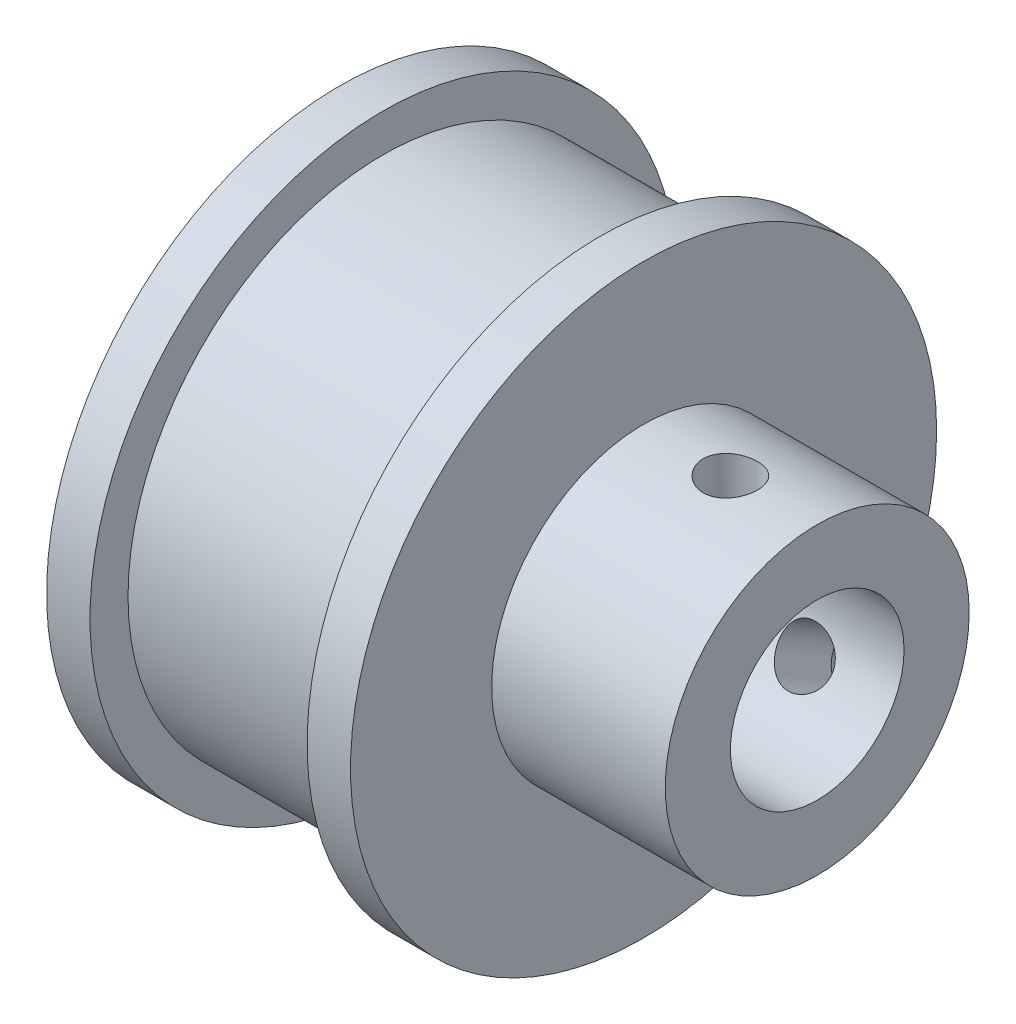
from build123d import *

# Parameters (mm, degrees)
SKETCH_1_R               = 13.5
EXTRUDE_1_DEPTH          = 22
SKETCH_2_OUTSIDE_W       = 37.814
SKETCH_2_OUTSIDE_H       = 37.814
SKETCH_2_OUTSIDE_R       = 11.75
CUT_EXTRUDE_1_DEPTH      = 10
SKETCH_3_OUTSIDE_W       = 37.814
SKETCH_3_OUTSIDE_H       = 37.814
SKETCH_3_OUTSIDE_R       = 7
CUT_EXTRUDE_2_DEPTH      = 8
SKETCH_4_R               = 4
CUT_EXTRUDE_3_DEPTH      = 30.129023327
SKETCH_5_R               = 1.25
CUT_EXTRUDE_4_DEPTH      = 30.129023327
PATTERN_CIRCULAR_1_COUNT = 2
PATTERN_CIRCULAR_1_ANGLE = 120


with BuildPart() as part:
    # Sketch 1 → Extrude 1 (new body)
    with BuildSketch(Plane(origin=(0, 0, 0), x_dir=(0, 0, -1), z_dir=(1, 0, 0))):
        Circle(SKETCH_1_R)
    extrude(amount=EXTRUDE_1_DEPTH)

    # Sketch 2 outside → Cut-Extrude 1 (cut)
    with BuildSketch(Plane(origin=(2, 0, 0), x_dir=(0, 0, -1), z_dir=(1, 0, 0))):
        Rectangle(SKETCH_2_OUTSIDE_W, SKETCH_2_OUTSIDE_H)
        Circle(SKETCH_2_OUTSIDE_R, mode=Mode.SUBTRACT)
    extrude(amount=CUT_EXTRUDE_1_DEPTH, mode=Mode.SUBTRACT)

    # Sketch 3 outside → Cut-Extrude 2 (cut)
    with BuildSketch(Plane(origin=(22, 0, 0), x_dir=(0, 0, -1), z_dir=(1, 0, 0))):
        Rectangle(SKETCH_3_OUTSIDE_W, SKETCH_3_OUTSIDE_H)
        Circle(SKETCH_3_OUTSIDE_R, mode=Mode.SUBTRACT)
    extrude(amount=-CUT_EXTRUDE_2_DEPTH, mode=Mode.SUBTRACT)

    # Sketch 4 → Cut-Extrude 3 (cut, through all)
    with BuildSketch(Plane(origin=(22, 0, 0), x_dir=(0, 0, -1), z_dir=(1, 0, 0))):
        Circle(SKETCH_4_R)
    extrude(amount=-CUT_EXTRUDE_3_DEPTH, mode=Mode.SUBTRACT)

    # Sketch 5 → Cut-Extrude 4 (cut, through all)
    with BuildSketch(Plane(origin=(0, 0, 0), x_dir=(1, 0, 0), z_dir=(0, 1, 0))):
        with Locations(Location((18, 0, 0), (0, 0, 90))):
            Circle(SKETCH_5_R)
    cut_extrude_4 = extrude(amount=CUT_EXTRUDE_4_DEPTH, mode=Mode.SUBTRACT)

    # Pattern Circular 1: Cut-Extrude 4 ×2 about axis
    pattern_circular_1_axis = Axis((14, 0, 0), (-1, 0, 0))
    for i in range(1, PATTERN_CIRCULAR_1_COUNT):
        add(cut_extrude_4.rotate(pattern_circular_1_axis, i * PATTERN_CIRCULAR_1_ANGLE / (PATTERN_CIRCULAR_1_COUNT - 1)), mode=Mode.SUBTRACT)


solid = part.part
